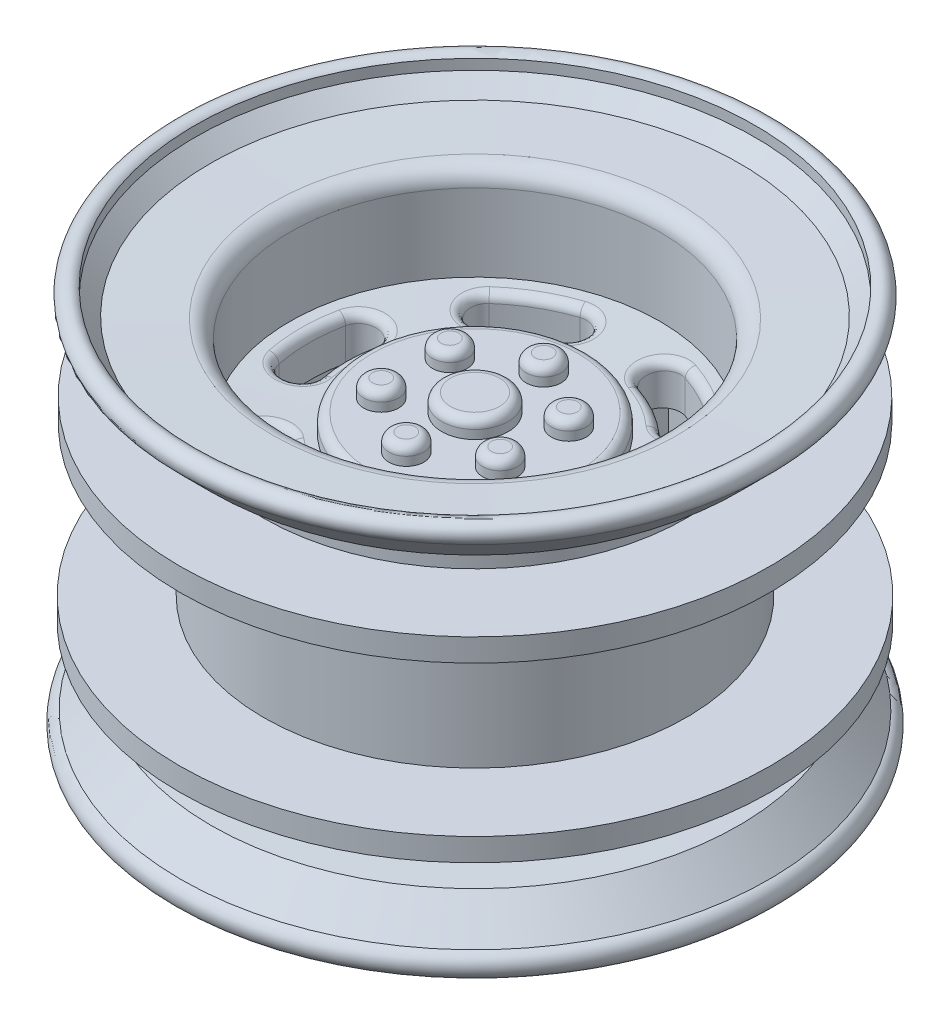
from build123d import *

# Parameters (mm, degrees)
ESQUISSE3_R                        = 1.9
EXTRUSION1_DEPTH                   = 1
ESQUISSE4_R                        = 1
EXTRUSION2_DEPTH                   = 1
CONG_1_R                           = 0.5
R_P_TITION_CIRCULAIRE1_COUNT       = 6
CONG_1_OF_R_P_TITION_CIRCULAIRE1_R = 0.5
ENL_V_MAT_EXTRU_1_DEPTH            = 32.298261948
CONG_2_R                           = 0.5
R_P_TITION_CIRCULAIRE3_COUNT       = 6
CONG_2_OF_R_P_TITION_CIRCULAIRE3_R = 0.5
EXTRUSION9_DEPTH                   = 0.5
CONG_3_R                           = 0.2
R_P_TITION_CIRCULAIRE4_COUNT       = 6
CONG_3_OF_R_P_TITION_CIRCULAIRE4_R = 0.2
ESQUISSE8_R                        = 1.95
ENL_V_MAT_EXTRU_2_DEPTH            = 18.5
CHANFREIN1_SIZE                    = 0.8


with BuildPart() as part:
    # Esquisse1 → R_volution2 (revolve)
    with BuildSketch(Plane.XY, mode=Mode.PRIVATE) as r_volution2_sk:
        with BuildLine():
            Line((10.579515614, 4), (6.379515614, 3.779887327))
            Line((6.379515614, 3.779887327), (6.35296957, 4.779534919))
            Line((6.35296957, 4.779534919), (0.052370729, 4.779534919))
            Line((0.052370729, 4.779534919), (0.052370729, -17.9))
            Line((0.052370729, -17.9), (4, -17.9))
            Line((4, -17.9), (4, 1.604010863))
            Line((4, 1.604010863), (10.579515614, 1.604010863))
            Line((10.579515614, 1.604010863), (10.579515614, 0))
            Line((10.579515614, 0), (10.579515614, -8.41669848))
            ThreePointArc((10.579515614, -8.41669848), (10.860175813, -9.11135685), (11.544616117, -9.416089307))
            Line((11.544616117, -9.416089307), (14.520066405, -9.519994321))
            Line((14.520066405, -9.519994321), (15.998754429, -10.998682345))
            ThreePointArc((15.998754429, -10.998682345), (17.163204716, -11.043002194), (16.809990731, -9.932529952))
            Line((16.809990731, -9.932529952), (15.073777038, -8.133763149))
            Line((15.073777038, -8.133763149), (12.222788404, -8.08331359))
            Line((12.222788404, -8.08331359), (12.222788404, -5.58331359))
            Line((12.222788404, -5.58331359), (16.891494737, -5.569799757))
            Line((16.891494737, -5.569799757), (16.88773183, -4.269805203))
            Line((16.88773183, -4.269805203), (12.079515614, -4.283722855))
            Line((12.079515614, -4.283722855), (12.079515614, 0))
            Line((12.079515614, 0), (12.079515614, 4.282462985))
            Line((12.079515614, 4.282462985), (16.847282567, 4.282462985))
            Line((16.847282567, 4.282462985), (16.847282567, 5.582462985))
            Line((16.847282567, 5.582462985), (12.079515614, 5.582462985))
            Line((12.079515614, 5.582462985), (12.079515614, 8.382462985))
            Line((12.079515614, 8.382462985), (15.079515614, 8.382462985))
            Line((15.079515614, 8.382462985), (16.847282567, 10.150229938))
            ThreePointArc((16.847282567, 10.150229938), (16.847903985, 10.998135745), (16, 11))
            Line((16, 11), (16, 10.407293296))
            Line((16, 10.407293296), (15.134223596, 9.541516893))
            Line((15.134223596, 9.541516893), (11.544616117, 9.416165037))
            ThreePointArc((11.544616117, 9.416165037), (10.860175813, 9.111432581), (10.579515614, 8.41677421))
            Line((10.579515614, 8.41677421), (10.579515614, 4))
        make_face()
    revolve(r_volution2_sk.sketch.rotate(Axis((0, 50, 0), (0, -1, 0)), 90), axis=Axis((0, 50, 0), (0, -1, 0)))

    # Esquisse3 → Extrusion1 (add)
    with BuildSketch(Plane(origin=(0, 4.779534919, 0), x_dir=(-1, 0, 0), z_dir=(0, 1, 0))):
        with Locations(Location((0, 0, 0), (0, 0, 270))):
            Circle(ESQUISSE3_R)
    extrude(amount=EXTRUSION1_DEPTH)

    # Esquisse4 → Extrusion2 (add)
    with BuildSketch(Plane(origin=(0, 4.779534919, 0), x_dir=(-1, 0, 0), z_dir=(0, 1, 0))):
        with Locations(Location((0, -3.924387, 0), (0, 0, 270))):
            Circle(ESQUISSE4_R)
    extrusion2 = extrude(amount=EXTRUSION2_DEPTH)

    # Cong_1
    cong_1_edges = [part.edges().sort_by_distance(p)[0] for p in [
        (0, 4.779534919, -6.35296957),
        (0, 5.779534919, 1.9),
        (0, 5.779534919, -2.924387),
    ]]
    fillet(cong_1_edges, radius=CONG_1_R)

    # R_p_tition circulaire1: Extrusion2 ×6 about axis
    r_p_tition_circulaire1_axis = Axis((0, 0, 0), (0, 1, 0))
    for i in range(1, R_P_TITION_CIRCULAIRE1_COUNT):
        add(extrusion2.rotate(r_p_tition_circulaire1_axis, i * 360 / R_P_TITION_CIRCULAIRE1_COUNT))

    # Cong_1 of R_p_tition circulaire1
    cong_1_of_r_p_tition_circulaire1_edges = [part.edges().sort_by_distance(p)[0] for p in [
        (-5.501833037, 4.779534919, -3.176484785),
        (1.645448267, 5.779534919, 0.95),
        (-2.532593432, 5.779534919, -1.4621935),
        (-5.501833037, 4.779534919, 3.176484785),
        (1.645448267, 5.779534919, -0.95),
        (-2.532593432, 5.779534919, 1.4621935),
        (0, 4.779534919, 6.35296957),
        (0, 5.779534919, -1.9),
        (0, 5.779534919, 2.924387),
        (5.501833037, 4.779534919, 3.176484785),
        (-1.645448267, 5.779534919, -0.95),
        (2.532593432, 5.779534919, 1.4621935),
        (5.501833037, 4.779534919, -3.176484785),
        (-1.645448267, 5.779534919, 0.95),
        (2.532593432, 5.779534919, -1.4621935),
    ]]
    fillet(cong_1_of_r_p_tition_circulaire1_edges, radius=CONG_1_OF_R_P_TITION_CIRCULAIRE1_R)

    # Esquisse5 → Enl_v. mat.-Extru.1 (cut, through all)
    with BuildSketch(Plane.XZ.offset(-1.604010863)):
        with BuildLine():
            ThreePointArc((9.307111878, -1.904643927), (9.5, 0), (9.307111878, 1.904643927))
            ThreePointArc((9.307111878, 1.904643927), (8.102467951, 2.7), (7.307111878, 1.495356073))
            ThreePointArc((7.307111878, 1.495356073), (7.458550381, 0), (7.307111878, -1.495356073))
            ThreePointArc((7.307111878, -1.495356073), (8.102467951, -2.7), (9.307111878, -1.904643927))
        make_face()
    enl_v_mat_extru_1 = extrude(amount=-ENL_V_MAT_EXTRU_1_DEPTH, mode=Mode.SUBTRACT)

    # Cong_2
    cong_2_edges = [part.edges().sort_by_distance(p)[0] for p in [
        (8.102358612, 3.893133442, -2.699977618),
        (7.45855038, 3.836437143, 0),
        (8.102358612, 3.893133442, 2.699977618),
        (9.499999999, 3.943424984, 0),
    ]]
    fillet(cong_2_edges, radius=CONG_2_R)

    # R_p_tition circulaire3: Enl_v. mat.-Extru.1 ×6 about axis
    r_p_tition_circulaire3_axis = Axis((0, 50, 0), (0, -1, 0))
    for i in range(1, R_P_TITION_CIRCULAIRE3_COUNT):
        add(enl_v_mat_extru_1.rotate(r_p_tition_circulaire3_axis, i * 360 / R_P_TITION_CIRCULAIRE3_COUNT), mode=Mode.SUBTRACT)

    # Cong_2 of R_p_tition circulaire3
    cong_2_of_r_p_tition_circulaire3_edges = [part.edges().sort_by_distance(p)[0] for p in [
        (6.389428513, 3.893133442, 5.66685958),
        (3.72927519, 3.836437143, 6.459294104),
        (1.712930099, 3.893133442, 8.366837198),
        (4.75, 3.943424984, 8.227241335),
        (-1.712930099, 3.893133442, 8.366837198),
        (-3.72927519, 3.836437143, 6.459294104),
        (-6.389428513, 3.893133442, 5.66685958),
        (-4.75, 3.943424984, 8.227241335),
        (-8.102358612, 3.893133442, 2.699977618),
        (-7.45855038, 3.836437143, 0),
        (-8.102358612, 3.893133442, -2.699977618),
        (-9.499999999, 3.943424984, 0),
        (-6.389428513, 3.893133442, -5.66685958),
        (-3.72927519, 3.836437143, -6.459294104),
        (-1.712930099, 3.893133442, -8.366837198),
        (-4.75, 3.943424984, -8.227241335),
        (1.712930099, 3.893133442, -8.366837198),
        (3.72927519, 3.836437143, -6.459294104),
        (6.389428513, 3.893133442, -5.66685958),
        (4.75, 3.943424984, -8.227241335),
    ]]
    fillet(cong_2_of_r_p_tition_circulaire3_edges, radius=CONG_2_OF_R_P_TITION_CIRCULAIRE3_R)

    # Esquisse7 → Extrusion9 (add, symmetric)
    with BuildSketch(Plane(origin=(0, 0, 0), x_dir=(0, 0, -1), z_dir=(1, 0, 0))):
        with BuildLine():
            Line((10.833807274, -7.606021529), (9.636673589, -6.502922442))
            ThreePointArc((9.636673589, -6.502922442), (8.521637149, -6.109264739), (7.467867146, -6.645773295))
            Line((7.467867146, -6.645773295), (3.610054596, -11.275380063))
            Line((3.610054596, -11.275380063), (3.610054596, 1.907968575))
            Line((3.610054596, 1.907968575), (10.833807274, 1.907968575))
            Line((10.833807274, 1.907968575), (10.833807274, -7.606021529))
        make_face()
    extrusion9 = extrude(amount=EXTRUSION9_DEPTH, both=True)

    # Cong_3
    cong_3_edges = [part.edges().sort_by_distance(p)[0] for p in [
        (-0.5, -8.745422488, -5.718247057),
        (-0.5, -6.931866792, -10.102183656),
        (0.5, -8.745422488, -5.718247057),
        (0.5, -6.109264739, -8.521637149),
        (0.5, -6.931866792, -10.102183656),
        (-0.5, -6.109264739, -8.521637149),
    ]]
    fillet(cong_3_edges, radius=CONG_3_R)

    # R_p_tition circulaire4: Extrusion9 ×6 about axis
    r_p_tition_circulaire4_axis = Axis((0, 0, 0), (0, 1, 0))
    for i in range(1, R_P_TITION_CIRCULAIRE4_COUNT):
        add(extrusion9.rotate(r_p_tition_circulaire4_axis, i * 360 / R_P_TITION_CIRCULAIRE4_COUNT))

    # Cong_3 of R_p_tition circulaire4
    cong_3_of_r_p_tition_circulaire4_edges = [part.edges().sort_by_distance(p)[0] for p in [
        (-5.202147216, -8.745422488, -2.426110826),
        (-8.99874768, -6.931866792, -4.618079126),
        (-4.702147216, -8.745422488, -3.29213623),
        (-7.129954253, -6.109264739, -4.693831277),
        (-8.49874768, -6.931866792, -5.48410453),
        (-7.629954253, -6.109264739, -3.827805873),
        (-4.702147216, -8.745422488, 3.29213623),
        (-8.49874768, -6.931866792, 5.48410453),
        (-5.202147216, -8.745422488, 2.426110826),
        (-7.629954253, -6.109264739, 3.827805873),
        (-8.99874768, -6.931866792, 4.618079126),
        (-7.129954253, -6.109264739, 4.693831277),
        (0.5, -8.745422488, 5.718247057),
        (0.5, -6.931866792, 10.102183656),
        (-0.5, -8.745422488, 5.718247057),
        (-0.5, -6.109264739, 8.521637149),
        (-0.5, -6.931866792, 10.102183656),
        (0.5, -6.109264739, 8.521637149),
        (5.202147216, -8.745422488, 2.426110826),
        (8.99874768, -6.931866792, 4.618079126),
        (4.702147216, -8.745422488, 3.29213623),
        (7.129954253, -6.109264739, 4.693831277),
        (8.49874768, -6.931866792, 5.48410453),
        (7.629954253, -6.109264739, 3.827805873),
        (4.702147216, -8.745422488, -3.29213623),
        (8.49874768, -6.931866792, -5.48410453),
        (5.202147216, -8.745422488, -2.426110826),
        (7.629954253, -6.109264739, -3.827805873),
        (8.99874768, -6.931866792, -4.618079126),
        (7.129954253, -6.109264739, -4.693831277),
    ]]
    fillet(cong_3_of_r_p_tition_circulaire4_edges, radius=CONG_3_OF_R_P_TITION_CIRCULAIRE4_R)

    # Esquisse8 → Enl_v. mat.-Extru.2 (cut)
    with BuildSketch(Plane.XZ.offset(17.9)):
        with Locations(Location((0, 0, 0), (0, 0, 270))):
            Circle(ESQUISSE8_R)
    extrude(amount=-ENL_V_MAT_EXTRU_2_DEPTH, mode=Mode.SUBTRACT)

    # Chanfrein1
    chanfrein1_edges = [part.edges().sort_by_distance(p)[0] for p in [
        (0, -17.9, 1.95),
    ]]
    chamfer(chanfrein1_edges, length=CHANFREIN1_SIZE)


solid = part.part
